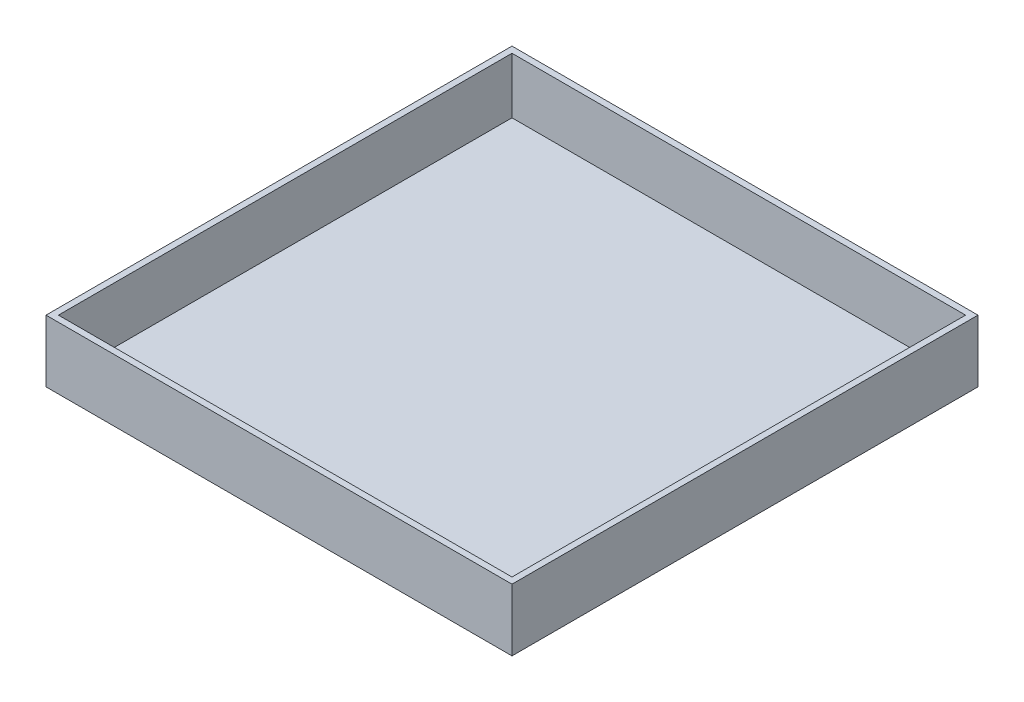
ISO-10303-21;
HEADER;
FILE_DESCRIPTION(('STEP AP214'),'2;1');
FILE_NAME('part.step','',(''),(''),'','','');
FILE_SCHEMA(('AUTOMOTIVE_DESIGN { 1 0 10303 214 1 1 1 1 }'));
ENDSEC;
DATA;
#1=APPLICATION_CONTEXT('core data for automotive mechanical design processes');
#2=APPLICATION_PROTOCOL_DEFINITION('international standard','automotive_design',2000,#1);
#3=PRODUCT_CONTEXT('',#1,'mechanical');
#4=PRODUCT('Part','Part','',(#3));
#5=PRODUCT_RELATED_PRODUCT_CATEGORY('part','',(#4));
#6=PRODUCT_DEFINITION_FORMATION('','',#4);
#7=PRODUCT_DEFINITION_CONTEXT('part definition',#1,'design');
#8=PRODUCT_DEFINITION('design','',#6,#7);
#9=PRODUCT_DEFINITION_SHAPE('','',#8);
#10=(LENGTH_UNIT() NAMED_UNIT(*) SI_UNIT(.MILLI.,.METRE.));
#11=(NAMED_UNIT(*) PLANE_ANGLE_UNIT() SI_UNIT($,.RADIAN.));
#12=(NAMED_UNIT(*) SI_UNIT($,.STERADIAN.) SOLID_ANGLE_UNIT());
#13=UNCERTAINTY_MEASURE_WITH_UNIT(LENGTH_MEASURE(1.E-05),#10,'distance_accuracy_value','');
#14=(GEOMETRIC_REPRESENTATION_CONTEXT(3) GLOBAL_UNCERTAINTY_ASSIGNED_CONTEXT((#13)) GLOBAL_UNIT_ASSIGNED_CONTEXT((#10,
#11,#12)) REPRESENTATION_CONTEXT('',''));
#15=CARTESIAN_POINT('',(0.,0.,0.));
#16=DIRECTION('',(0.,0.,1.));
#17=DIRECTION('',(1.,0.,0.));
#18=AXIS2_PLACEMENT_3D('',#15,#16,#17);
#19=CARTESIAN_POINT('',(-75.,20.,-75.));
#20=DIRECTION('',(1.,0.,0.));
#21=DIRECTION('',(0.,0.,-1.));
#22=AXIS2_PLACEMENT_3D('',#19,#20,#21);
#23=PLANE('',#22);
#24=DIRECTION('',(0.,0.,1.));
#25=VECTOR('',#24,1.);
#26=CARTESIAN_POINT('',(-75.,0.,-75.));
#27=LINE('',#26,#25);
#28=CARTESIAN_POINT('',(-75.,0.,-75.));
#29=VERTEX_POINT('',#28);
#30=CARTESIAN_POINT('',(-75.,0.,75.));
#31=VERTEX_POINT('',#30);
#32=EDGE_CURVE('E131',#29,#31,#27,.T.);
#33=ORIENTED_EDGE('',*,*,#32,.T.);
#34=DIRECTION('',(0.,-1.,0.));
#35=VECTOR('',#34,1.);
#36=CARTESIAN_POINT('',(-75.,20.,75.));
#37=LINE('',#36,#35);
#38=CARTESIAN_POINT('',(-75.,20.,75.));
#39=VERTEX_POINT('',#38);
#40=EDGE_CURVE('E11',#39,#31,#37,.T.);
#41=ORIENTED_EDGE('',*,*,#40,.F.);
#42=DIRECTION('',(0.,0.,1.));
#43=VECTOR('',#42,1.);
#44=CARTESIAN_POINT('',(-75.,20.,-75.));
#45=LINE('',#44,#43);
#46=CARTESIAN_POINT('',(-75.,20.,-75.));
#47=VERTEX_POINT('',#46);
#48=EDGE_CURVE('E140',#47,#39,#45,.T.);
#49=ORIENTED_EDGE('',*,*,#48,.F.);
#50=DIRECTION('',(0.,-1.,0.));
#51=VECTOR('',#50,1.);
#52=CARTESIAN_POINT('',(-75.,20.,-75.));
#53=LINE('',#52,#51);
#54=EDGE_CURVE('E147',#47,#29,#53,.T.);
#55=ORIENTED_EDGE('',*,*,#54,.T.);
#56=EDGE_LOOP('',(#33,#41,#49,#55));
#57=FACE_BOUND('',#56,.T.);
#58=ADVANCED_FACE('F32',(#57),#23,.F.);
#59=CARTESIAN_POINT('',(-75.,20.,75.));
#60=DIRECTION('',(0.,0.,-1.));
#61=DIRECTION('',(-1.,0.,0.));
#62=AXIS2_PLACEMENT_3D('',#59,#60,#61);
#63=PLANE('',#62);
#64=DIRECTION('',(1.,0.,0.));
#65=VECTOR('',#64,1.);
#66=CARTESIAN_POINT('',(-75.,0.,75.));
#67=LINE('',#66,#65);
#68=CARTESIAN_POINT('',(75.,0.,75.));
#69=VERTEX_POINT('',#68);
#70=EDGE_CURVE('E134',#31,#69,#67,.T.);
#71=ORIENTED_EDGE('',*,*,#70,.T.);
#72=DIRECTION('',(0.,-1.,0.));
#73=VECTOR('',#72,1.);
#74=CARTESIAN_POINT('',(75.,20.,75.));
#75=LINE('',#74,#73);
#76=CARTESIAN_POINT('',(75.,20.,75.));
#77=VERTEX_POINT('',#76);
#78=EDGE_CURVE('E39',#77,#69,#75,.T.);
#79=ORIENTED_EDGE('',*,*,#78,.F.);
#80=DIRECTION('',(1.,0.,0.));
#81=VECTOR('',#80,1.);
#82=CARTESIAN_POINT('',(-75.,20.,75.));
#83=LINE('',#82,#81);
#84=EDGE_CURVE('E142',#39,#77,#83,.T.);
#85=ORIENTED_EDGE('',*,*,#84,.F.);
#86=ORIENTED_EDGE('',*,*,#40,.T.);
#87=EDGE_LOOP('',(#71,#79,#85,#86));
#88=FACE_BOUND('',#87,.T.);
#89=ADVANCED_FACE('F170',(#88),#63,.F.);
#90=CARTESIAN_POINT('',(75.,20.,-75.));
#91=DIRECTION('',(-1.,0.,0.));
#92=DIRECTION('',(0.,0.,1.));
#93=AXIS2_PLACEMENT_3D('',#90,#91,#92);
#94=PLANE('',#93);
#95=DIRECTION('',(0.,0.,-1.));
#96=VECTOR('',#95,1.);
#97=CARTESIAN_POINT('',(75.,0.,-75.));
#98=LINE('',#97,#96);
#99=CARTESIAN_POINT('',(75.,0.,-75.));
#100=VERTEX_POINT('',#99);
#101=EDGE_CURVE('E136',#69,#100,#98,.T.);
#102=ORIENTED_EDGE('',*,*,#101,.T.);
#103=DIRECTION('',(0.,-1.,0.));
#104=VECTOR('',#103,1.);
#105=CARTESIAN_POINT('',(75.,20.,-75.));
#106=LINE('',#105,#104);
#107=CARTESIAN_POINT('',(75.,20.,-75.));
#108=VERTEX_POINT('',#107);
#109=EDGE_CURVE('E150',#108,#100,#106,.T.);
#110=ORIENTED_EDGE('',*,*,#109,.F.);
#111=DIRECTION('',(0.,0.,-1.));
#112=VECTOR('',#111,1.);
#113=CARTESIAN_POINT('',(75.,20.,-75.));
#114=LINE('',#113,#112);
#115=EDGE_CURVE('E144',#77,#108,#114,.T.);
#116=ORIENTED_EDGE('',*,*,#115,.F.);
#117=ORIENTED_EDGE('',*,*,#78,.T.);
#118=EDGE_LOOP('',(#102,#110,#116,#117));
#119=FACE_BOUND('',#118,.T.);
#120=ADVANCED_FACE('F157',(#119),#94,.F.);
#121=CARTESIAN_POINT('',(-75.,20.,-75.));
#122=DIRECTION('',(0.,0.,1.));
#123=DIRECTION('',(1.,0.,0.));
#124=AXIS2_PLACEMENT_3D('',#121,#122,#123);
#125=PLANE('',#124);
#126=DIRECTION('',(-1.,0.,0.));
#127=VECTOR('',#126,1.);
#128=CARTESIAN_POINT('',(-75.,0.,-75.));
#129=LINE('',#128,#127);
#130=EDGE_CURVE('E138',#100,#29,#129,.T.);
#131=ORIENTED_EDGE('',*,*,#130,.T.);
#132=ORIENTED_EDGE('',*,*,#54,.F.);
#133=DIRECTION('',(-1.,0.,0.));
#134=VECTOR('',#133,1.);
#135=CARTESIAN_POINT('',(-75.,20.,-75.));
#136=LINE('',#135,#134);
#137=EDGE_CURVE('E54',#108,#47,#136,.T.);
#138=ORIENTED_EDGE('',*,*,#137,.F.);
#139=ORIENTED_EDGE('',*,*,#109,.T.);
#140=EDGE_LOOP('',(#131,#132,#138,#139));
#141=FACE_BOUND('',#140,.T.);
#142=ADVANCED_FACE('F165',(#141),#125,.F.);
#143=CARTESIAN_POINT('',(-75.,20.,75.));
#144=DIRECTION('',(0.,1.,0.));
#145=DIRECTION('',(0.,0.,1.));
#146=AXIS2_PLACEMENT_3D('',#143,#144,#145);
#147=PLANE('',#146);
#148=DIRECTION('',(0.,0.,1.));
#149=VECTOR('',#148,1.);
#150=CARTESIAN_POINT('',(-73.,20.,-75.));
#151=LINE('',#150,#149);
#152=CARTESIAN_POINT('',(-73.,20.,-73.));
#153=VERTEX_POINT('',#152);
#154=CARTESIAN_POINT('',(-73.,20.,73.));
#155=VERTEX_POINT('',#154);
#156=EDGE_CURVE('E120',#153,#155,#151,.T.);
#157=ORIENTED_EDGE('',*,*,#156,.F.);
#158=DIRECTION('',(-1.,0.,0.));
#159=VECTOR('',#158,1.);
#160=CARTESIAN_POINT('',(-75.,20.,-73.));
#161=LINE('',#160,#159);
#162=CARTESIAN_POINT('',(73.,20.,-73.));
#163=VERTEX_POINT('',#162);
#164=EDGE_CURVE('E129',#163,#153,#161,.T.);
#165=ORIENTED_EDGE('',*,*,#164,.F.);
#166=DIRECTION('',(0.,0.,-1.));
#167=VECTOR('',#166,1.);
#168=CARTESIAN_POINT('',(73.,20.,-75.));
#169=LINE('',#168,#167);
#170=CARTESIAN_POINT('',(73.,20.,73.));
#171=VERTEX_POINT('',#170);
#172=EDGE_CURVE('E127',#171,#163,#169,.T.);
#173=ORIENTED_EDGE('',*,*,#172,.F.);
#174=DIRECTION('',(1.,0.,0.));
#175=VECTOR('',#174,1.);
#176=CARTESIAN_POINT('',(-75.,20.,73.));
#177=LINE('',#176,#175);
#178=EDGE_CURVE('E112',#155,#171,#177,.T.);
#179=ORIENTED_EDGE('',*,*,#178,.F.);
#180=EDGE_LOOP('',(#157,#165,#173,#179));
#181=FACE_BOUND('',#180,.T.);
#182=ORIENTED_EDGE('',*,*,#48,.T.);
#183=ORIENTED_EDGE('',*,*,#84,.T.);
#184=ORIENTED_EDGE('',*,*,#115,.T.);
#185=ORIENTED_EDGE('',*,*,#137,.T.);
#186=EDGE_LOOP('',(#182,#183,#184,#185));
#187=FACE_BOUND('',#186,.T.);
#188=ADVANCED_FACE('F169',(#181,#187),#147,.T.);
#189=CARTESIAN_POINT('',(-75.,0.,75.));
#190=DIRECTION('',(0.,1.,0.));
#191=DIRECTION('',(0.,0.,1.));
#192=AXIS2_PLACEMENT_3D('',#189,#190,#191);
#193=PLANE('',#192);
#194=ORIENTED_EDGE('',*,*,#32,.F.);
#195=ORIENTED_EDGE('',*,*,#130,.F.);
#196=ORIENTED_EDGE('',*,*,#101,.F.);
#197=ORIENTED_EDGE('',*,*,#70,.F.);
#198=EDGE_LOOP('',(#194,#195,#196,#197));
#199=FACE_BOUND('',#198,.T.);
#200=ADVANCED_FACE('F163',(#199),#193,.F.);
#201=CARTESIAN_POINT('',(-73.,20.,-75.));
#202=DIRECTION('',(1.,0.,0.));
#203=DIRECTION('',(0.,0.,-1.));
#204=AXIS2_PLACEMENT_3D('',#201,#202,#203);
#205=PLANE('',#204);
#206=DIRECTION('',(0.,0.,1.));
#207=VECTOR('',#206,1.);
#208=CARTESIAN_POINT('',(-73.,2.,-75.));
#209=LINE('',#208,#207);
#210=CARTESIAN_POINT('',(-73.,2.,-73.));
#211=VERTEX_POINT('',#210);
#212=CARTESIAN_POINT('',(-73.,2.,73.));
#213=VERTEX_POINT('',#212);
#214=EDGE_CURVE('E103',#211,#213,#209,.T.);
#215=ORIENTED_EDGE('',*,*,#214,.F.);
#216=DIRECTION('',(0.,-1.,0.));
#217=VECTOR('',#216,1.);
#218=CARTESIAN_POINT('',(-73.,20.,-73.));
#219=LINE('',#218,#217);
#220=EDGE_CURVE('E123',#153,#211,#219,.T.);
#221=ORIENTED_EDGE('',*,*,#220,.F.);
#222=ORIENTED_EDGE('',*,*,#156,.T.);
#223=DIRECTION('',(0.,-1.,0.));
#224=VECTOR('',#223,1.);
#225=CARTESIAN_POINT('',(-73.,20.,73.));
#226=LINE('',#225,#224);
#227=EDGE_CURVE('E115',#155,#213,#226,.T.);
#228=ORIENTED_EDGE('',*,*,#227,.T.);
#229=EDGE_LOOP('',(#215,#221,#222,#228));
#230=FACE_BOUND('',#229,.T.);
#231=ADVANCED_FACE('F185',(#230),#205,.T.);
#232=CARTESIAN_POINT('',(-75.,20.,73.));
#233=DIRECTION('',(0.,0.,-1.));
#234=DIRECTION('',(-1.,0.,0.));
#235=AXIS2_PLACEMENT_3D('',#232,#233,#234);
#236=PLANE('',#235);
#237=DIRECTION('',(1.,0.,0.));
#238=VECTOR('',#237,1.);
#239=CARTESIAN_POINT('',(-75.,2.,73.));
#240=LINE('',#239,#238);
#241=CARTESIAN_POINT('',(73.,2.,73.));
#242=VERTEX_POINT('',#241);
#243=EDGE_CURVE('E97',#213,#242,#240,.T.);
#244=ORIENTED_EDGE('',*,*,#243,.F.);
#245=ORIENTED_EDGE('',*,*,#227,.F.);
#246=ORIENTED_EDGE('',*,*,#178,.T.);
#247=DIRECTION('',(0.,-1.,0.));
#248=VECTOR('',#247,1.);
#249=CARTESIAN_POINT('',(73.,20.,73.));
#250=LINE('',#249,#248);
#251=EDGE_CURVE('E109',#171,#242,#250,.T.);
#252=ORIENTED_EDGE('',*,*,#251,.T.);
#253=EDGE_LOOP('',(#244,#245,#246,#252));
#254=FACE_BOUND('',#253,.T.);
#255=ADVANCED_FACE('F110',(#254),#236,.T.);
#256=CARTESIAN_POINT('',(73.,20.,-75.));
#257=DIRECTION('',(-1.,0.,0.));
#258=DIRECTION('',(0.,0.,1.));
#259=AXIS2_PLACEMENT_3D('',#256,#257,#258);
#260=PLANE('',#259);
#261=DIRECTION('',(0.,0.,-1.));
#262=VECTOR('',#261,1.);
#263=CARTESIAN_POINT('',(73.,2.,-75.));
#264=LINE('',#263,#262);
#265=CARTESIAN_POINT('',(73.,2.,-73.));
#266=VERTEX_POINT('',#265);
#267=EDGE_CURVE('E101',#242,#266,#264,.T.);
#268=ORIENTED_EDGE('',*,*,#267,.F.);
#269=ORIENTED_EDGE('',*,*,#251,.F.);
#270=ORIENTED_EDGE('',*,*,#172,.T.);
#271=DIRECTION('',(0.,-1.,0.));
#272=VECTOR('',#271,1.);
#273=CARTESIAN_POINT('',(73.,20.,-73.));
#274=LINE('',#273,#272);
#275=EDGE_CURVE('E46',#163,#266,#274,.T.);
#276=ORIENTED_EDGE('',*,*,#275,.T.);
#277=EDGE_LOOP('',(#268,#269,#270,#276));
#278=FACE_BOUND('',#277,.T.);
#279=ADVANCED_FACE('F117',(#278),#260,.T.);
#280=CARTESIAN_POINT('',(-75.,20.,-73.));
#281=DIRECTION('',(0.,0.,1.));
#282=DIRECTION('',(1.,0.,0.));
#283=AXIS2_PLACEMENT_3D('',#280,#281,#282);
#284=PLANE('',#283);
#285=DIRECTION('',(-1.,0.,0.));
#286=VECTOR('',#285,1.);
#287=CARTESIAN_POINT('',(-75.,2.,-73.));
#288=LINE('',#287,#286);
#289=EDGE_CURVE('E118',#266,#211,#288,.T.);
#290=ORIENTED_EDGE('',*,*,#289,.F.);
#291=ORIENTED_EDGE('',*,*,#275,.F.);
#292=ORIENTED_EDGE('',*,*,#164,.T.);
#293=ORIENTED_EDGE('',*,*,#220,.T.);
#294=EDGE_LOOP('',(#290,#291,#292,#293));
#295=FACE_BOUND('',#294,.T.);
#296=ADVANCED_FACE('F188',(#295),#284,.T.);
#297=CARTESIAN_POINT('',(-75.,2.,75.));
#298=DIRECTION('',(0.,1.,0.));
#299=DIRECTION('',(0.,0.,1.));
#300=AXIS2_PLACEMENT_3D('',#297,#298,#299);
#301=PLANE('',#300);
#302=ORIENTED_EDGE('',*,*,#214,.T.);
#303=ORIENTED_EDGE('',*,*,#243,.T.);
#304=ORIENTED_EDGE('',*,*,#267,.T.);
#305=ORIENTED_EDGE('',*,*,#289,.T.);
#306=EDGE_LOOP('',(#302,#303,#304,#305));
#307=FACE_BOUND('',#306,.T.);
#308=ADVANCED_FACE('F99',(#307),#301,.T.);
#309=CLOSED_SHELL('',(#58,#89,#120,#142,#188,#200,#231,#255,#279,#296,#308));
#310=MANIFOLD_SOLID_BREP('B2',#309);
#311=ADVANCED_BREP_SHAPE_REPRESENTATION('',(#18,#310),#14);
#312=SHAPE_DEFINITION_REPRESENTATION(#9,#311);
ENDSEC;
END-ISO-10303-21;
